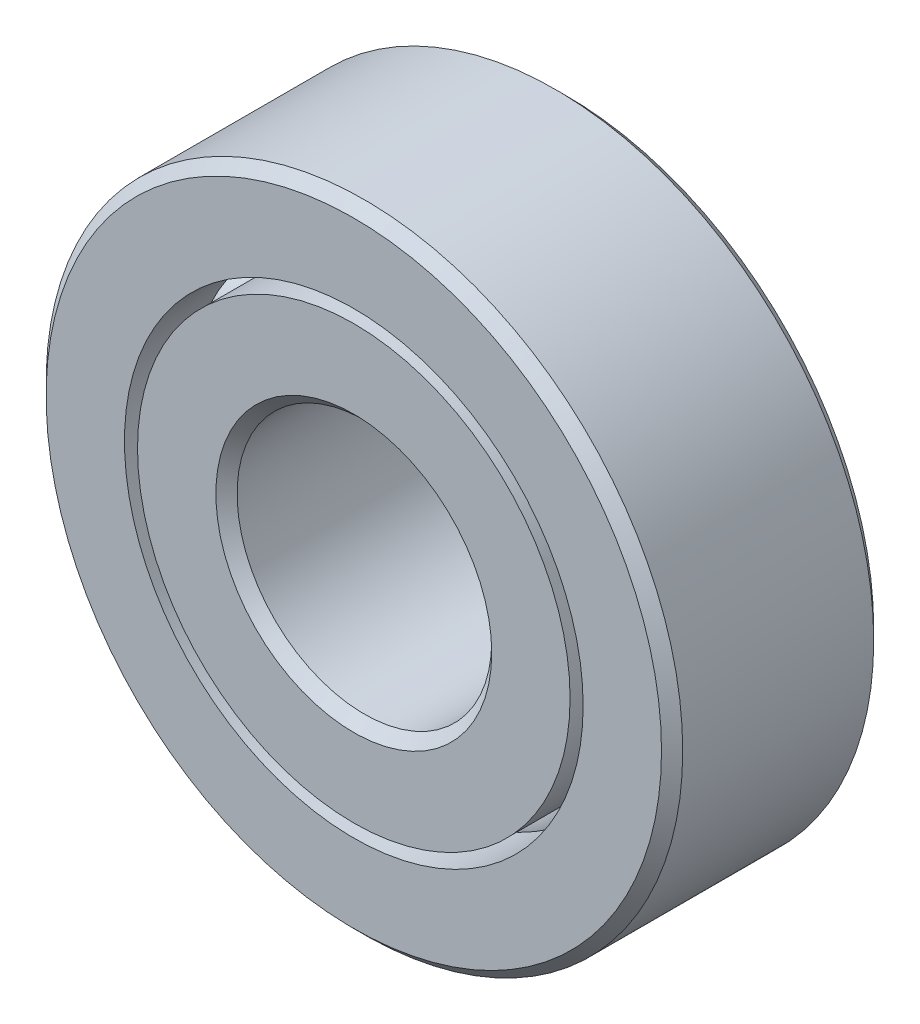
ISO-10303-21;
HEADER;
FILE_DESCRIPTION(('STEP AP214'),'2;1');
FILE_NAME('part.step','',(''),(''),'','','');
FILE_SCHEMA(('AUTOMOTIVE_DESIGN { 1 0 10303 214 1 1 1 1 }'));
ENDSEC;
DATA;
#1=APPLICATION_CONTEXT('core data for automotive mechanical design processes');
#2=APPLICATION_PROTOCOL_DEFINITION('international standard','automotive_design',2000,#1);
#3=PRODUCT_CONTEXT('',#1,'mechanical');
#4=PRODUCT('Part','Part','',(#3));
#5=PRODUCT_RELATED_PRODUCT_CATEGORY('part','',(#4));
#6=PRODUCT_DEFINITION_FORMATION('','',#4);
#7=PRODUCT_DEFINITION_CONTEXT('part definition',#1,'design');
#8=PRODUCT_DEFINITION('design','',#6,#7);
#9=PRODUCT_DEFINITION_SHAPE('','',#8);
#10=(LENGTH_UNIT() NAMED_UNIT(*) SI_UNIT(.MILLI.,.METRE.));
#11=(NAMED_UNIT(*) PLANE_ANGLE_UNIT() SI_UNIT($,.RADIAN.));
#12=(NAMED_UNIT(*) SI_UNIT($,.STERADIAN.) SOLID_ANGLE_UNIT());
#13=UNCERTAINTY_MEASURE_WITH_UNIT(LENGTH_MEASURE(1.E-05),#10,'distance_accuracy_value','');
#14=(GEOMETRIC_REPRESENTATION_CONTEXT(3) GLOBAL_UNCERTAINTY_ASSIGNED_CONTEXT((#13)) GLOBAL_UNIT_ASSIGNED_CONTEXT((#10,
#11,#12)) REPRESENTATION_CONTEXT('',''));
#15=CARTESIAN_POINT('',(0.,0.,0.));
#16=DIRECTION('',(0.,0.,1.));
#17=DIRECTION('',(1.,0.,0.));
#18=AXIS2_PLACEMENT_3D('',#15,#16,#17);
#19=CARTESIAN_POINT('',(-2.00908801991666,4.85036754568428,0.));
#20=DIRECTION('',(0.,0.,1.));
#21=DIRECTION('',(-0.382683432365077,0.923879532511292,0.));
#22=AXIS2_PLACEMENT_3D('',#19,#20,#21);
#23=SPHERICAL_SURFACE('',#22,1.);
#24=CARTESIAN_POINT('',(-2.00908801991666,4.85036754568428,1.));
#25=VERTEX_POINT('',#24);
#26=VERTEX_LOOP('',#25);
#27=FACE_BOUND('',#26,.T.);
#28=ADVANCED_FACE('F43',(#27),#23,.T.);
#29=CLOSED_SHELL('',(#28));
#30=MANIFOLD_SOLID_BREP('B2',#29);
#31=CARTESIAN_POINT('',(-3.71231060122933,3.71231060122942,0.));
#32=DIRECTION('',(0.,0.,1.));
#33=DIRECTION('',(-0.707106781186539,0.707106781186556,0.));
#34=AXIS2_PLACEMENT_3D('',#31,#32,#33);
#35=SPHERICAL_SURFACE('',#34,1.);
#36=CARTESIAN_POINT('',(-3.71231060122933,3.71231060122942,1.));
#37=VERTEX_POINT('',#36);
#38=VERTEX_LOOP('',#37);
#39=FACE_BOUND('',#38,.T.);
#40=ADVANCED_FACE('F63',(#39),#35,.T.);
#41=CLOSED_SHELL('',(#40));
#42=MANIFOLD_SOLID_BREP('B6',#41);
#43=CARTESIAN_POINT('',(-4.85036754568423,2.00908801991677,0.));
#44=DIRECTION('',(0.,0.,1.));
#45=DIRECTION('',(-0.923879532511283,0.3826834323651,0.));
#46=AXIS2_PLACEMENT_3D('',#43,#44,#45);
#47=SPHERICAL_SURFACE('',#46,1.);
#48=CARTESIAN_POINT('',(-4.85036754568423,2.00908801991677,1.));
#49=VERTEX_POINT('',#48);
#50=VERTEX_LOOP('',#49);
#51=FACE_BOUND('',#50,.T.);
#52=ADVANCED_FACE('F83',(#51),#47,.T.);
#53=CLOSED_SHELL('',(#52));
#54=MANIFOLD_SOLID_BREP('B39',#53);
#55=CARTESIAN_POINT('',(-5.25,0.,0.));
#56=DIRECTION('',(0.,0.,1.));
#57=DIRECTION('',(-1.,0.,0.));
#58=AXIS2_PLACEMENT_3D('',#55,#56,#57);
#59=SPHERICAL_SURFACE('',#58,1.);
#60=CARTESIAN_POINT('',(-5.25,0.,1.));
#61=VERTEX_POINT('',#60);
#62=VERTEX_LOOP('',#61);
#63=FACE_BOUND('',#62,.T.);
#64=ADVANCED_FACE('F103',(#63),#59,.T.);
#65=CLOSED_SHELL('',(#64));
#66=MANIFOLD_SOLID_BREP('B59',#65);
#67=CARTESIAN_POINT('',(-4.85036754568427,-2.00908801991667,0.));
#68=DIRECTION('',(0.,0.,1.));
#69=DIRECTION('',(-0.923879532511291,-0.382683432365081,0.));
#70=AXIS2_PLACEMENT_3D('',#67,#68,#69);
#71=SPHERICAL_SURFACE('',#70,1.);
#72=CARTESIAN_POINT('',(-4.85036754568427,-2.00908801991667,1.));
#73=VERTEX_POINT('',#72);
#74=VERTEX_LOOP('',#73);
#75=FACE_BOUND('',#74,.T.);
#76=ADVANCED_FACE('F123',(#75),#71,.T.);
#77=CLOSED_SHELL('',(#76));
#78=MANIFOLD_SOLID_BREP('B79',#77);
#79=CARTESIAN_POINT('',(-3.71231060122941,-3.71231060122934,0.));
#80=DIRECTION('',(0.,0.,1.));
#81=DIRECTION('',(-0.707106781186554,-0.707106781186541,0.));
#82=AXIS2_PLACEMENT_3D('',#79,#80,#81);
#83=SPHERICAL_SURFACE('',#82,1.);
#84=CARTESIAN_POINT('',(-3.71231060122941,-3.71231060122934,1.));
#85=VERTEX_POINT('',#84);
#86=VERTEX_LOOP('',#85);
#87=FACE_BOUND('',#86,.T.);
#88=ADVANCED_FACE('F143',(#87),#83,.T.);
#89=CLOSED_SHELL('',(#88));
#90=MANIFOLD_SOLID_BREP('B99',#89);
#91=CARTESIAN_POINT('',(-2.00908801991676,-4.85036754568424,0.));
#92=DIRECTION('',(0.,0.,1.));
#93=DIRECTION('',(-0.382683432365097,-0.923879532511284,0.));
#94=AXIS2_PLACEMENT_3D('',#91,#92,#93);
#95=SPHERICAL_SURFACE('',#94,1.);
#96=CARTESIAN_POINT('',(-2.00908801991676,-4.85036754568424,1.));
#97=VERTEX_POINT('',#96);
#98=VERTEX_LOOP('',#97);
#99=FACE_BOUND('',#98,.T.);
#100=ADVANCED_FACE('F163',(#99),#95,.T.);
#101=CLOSED_SHELL('',(#100));
#102=MANIFOLD_SOLID_BREP('B119',#101);
#103=CARTESIAN_POINT('',(0.,-5.25,0.));
#104=DIRECTION('',(0.,0.,1.));
#105=DIRECTION('',(0.,-1.,0.));
#106=AXIS2_PLACEMENT_3D('',#103,#104,#105);
#107=SPHERICAL_SURFACE('',#106,1.);
#108=CARTESIAN_POINT('',(0.,-5.25,1.));
#109=VERTEX_POINT('',#108);
#110=VERTEX_LOOP('',#109);
#111=FACE_BOUND('',#110,.T.);
#112=ADVANCED_FACE('F183',(#111),#107,.T.);
#113=CLOSED_SHELL('',(#112));
#114=MANIFOLD_SOLID_BREP('B139',#113);
#115=CARTESIAN_POINT('',(2.00908801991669,-4.85036754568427,0.));
#116=DIRECTION('',(0.,0.,1.));
#117=DIRECTION('',(0.382683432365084,-0.923879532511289,0.));
#118=AXIS2_PLACEMENT_3D('',#115,#116,#117);
#119=SPHERICAL_SURFACE('',#118,1.);
#120=CARTESIAN_POINT('',(2.00908801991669,-4.85036754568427,1.));
#121=VERTEX_POINT('',#120);
#122=VERTEX_LOOP('',#121);
#123=FACE_BOUND('',#122,.T.);
#124=ADVANCED_FACE('F203',(#123),#119,.T.);
#125=CLOSED_SHELL('',(#124));
#126=MANIFOLD_SOLID_BREP('B159',#125);
#127=CARTESIAN_POINT('',(3.71231060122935,-3.71231060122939,0.));
#128=DIRECTION('',(0.,0.,1.));
#129=DIRECTION('',(0.707106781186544,-0.707106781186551,0.));
#130=AXIS2_PLACEMENT_3D('',#127,#128,#129);
#131=SPHERICAL_SURFACE('',#130,1.);
#132=CARTESIAN_POINT('',(3.71231060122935,-3.71231060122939,1.));
#133=VERTEX_POINT('',#132);
#134=VERTEX_LOOP('',#133);
#135=FACE_BOUND('',#134,.T.);
#136=ADVANCED_FACE('F223',(#135),#131,.T.);
#137=CLOSED_SHELL('',(#136));
#138=MANIFOLD_SOLID_BREP('B179',#137);
#139=CARTESIAN_POINT('',(4.85036754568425,-2.00908801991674,0.));
#140=DIRECTION('',(0.,0.,1.));
#141=DIRECTION('',(0.923879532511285,-0.382683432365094,0.));
#142=AXIS2_PLACEMENT_3D('',#139,#140,#141);
#143=SPHERICAL_SURFACE('',#142,1.);
#144=CARTESIAN_POINT('',(4.85036754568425,-2.00908801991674,1.));
#145=VERTEX_POINT('',#144);
#146=VERTEX_LOOP('',#145);
#147=FACE_BOUND('',#146,.T.);
#148=ADVANCED_FACE('F243',(#147),#143,.T.);
#149=CLOSED_SHELL('',(#148));
#150=MANIFOLD_SOLID_BREP('B199',#149);
#151=CARTESIAN_POINT('',(5.25,0.,0.));
#152=DIRECTION('',(0.,0.,1.));
#153=DIRECTION('',(1.,0.,0.));
#154=AXIS2_PLACEMENT_3D('',#151,#152,#153);
#155=SPHERICAL_SURFACE('',#154,1.);
#156=CARTESIAN_POINT('',(5.25,0.,1.));
#157=VERTEX_POINT('',#156);
#158=VERTEX_LOOP('',#157);
#159=FACE_BOUND('',#158,.T.);
#160=ADVANCED_FACE('F263',(#159),#155,.T.);
#161=CLOSED_SHELL('',(#160));
#162=MANIFOLD_SOLID_BREP('B219',#161);
#163=CARTESIAN_POINT('',(4.85036754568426,2.00908801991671,0.));
#164=DIRECTION('',(0.,0.,1.));
#165=DIRECTION('',(0.923879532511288,0.382683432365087,0.));
#166=AXIS2_PLACEMENT_3D('',#163,#164,#165);
#167=SPHERICAL_SURFACE('',#166,1.);
#168=CARTESIAN_POINT('',(4.85036754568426,2.00908801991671,1.));
#169=VERTEX_POINT('',#168);
#170=VERTEX_LOOP('',#169);
#171=FACE_BOUND('',#170,.T.);
#172=ADVANCED_FACE('F283',(#171),#167,.T.);
#173=CLOSED_SHELL('',(#172));
#174=MANIFOLD_SOLID_BREP('B239',#173);
#175=CARTESIAN_POINT('',(3.71231060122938,3.71231060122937,0.));
#176=DIRECTION('',(0.,0.,1.));
#177=DIRECTION('',(0.707106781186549,0.707106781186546,0.));
#178=AXIS2_PLACEMENT_3D('',#175,#176,#177);
#179=SPHERICAL_SURFACE('',#178,1.);
#180=CARTESIAN_POINT('',(3.71231060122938,3.71231060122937,1.));
#181=VERTEX_POINT('',#180);
#182=VERTEX_LOOP('',#181);
#183=FACE_BOUND('',#182,.T.);
#184=ADVANCED_FACE('F303',(#183),#179,.T.);
#185=CLOSED_SHELL('',(#184));
#186=MANIFOLD_SOLID_BREP('B259',#185);
#187=CARTESIAN_POINT('',(2.00908801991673,4.85036754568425,0.));
#188=DIRECTION('',(0.,0.,1.));
#189=DIRECTION('',(0.382683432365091,0.923879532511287,0.));
#190=AXIS2_PLACEMENT_3D('',#187,#188,#189);
#191=SPHERICAL_SURFACE('',#190,1.);
#192=CARTESIAN_POINT('',(2.00908801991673,4.85036754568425,1.));
#193=VERTEX_POINT('',#192);
#194=VERTEX_LOOP('',#193);
#195=FACE_BOUND('',#194,.T.);
#196=ADVANCED_FACE('F323',(#195),#191,.T.);
#197=CLOSED_SHELL('',(#196));
#198=MANIFOLD_SOLID_BREP('B279',#197);
#199=CARTESIAN_POINT('',(0.,5.25,0.));
#200=DIRECTION('',(0.,0.,1.));
#201=DIRECTION('',(0.,1.,0.));
#202=AXIS2_PLACEMENT_3D('',#199,#200,#201);
#203=SPHERICAL_SURFACE('',#202,1.);
#204=CARTESIAN_POINT('',(0.,5.25,1.));
#205=VERTEX_POINT('',#204);
#206=VERTEX_LOOP('',#205);
#207=FACE_BOUND('',#206,.T.);
#208=ADVANCED_FACE('F345',(#207),#203,.T.);
#209=CLOSED_SHELL('',(#208));
#210=MANIFOLD_SOLID_BREP('B299',#209);
#211=CARTESIAN_POINT('',(0.,5.09615384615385,2.5));
#212=DIRECTION('',(0.,0.,-1.));
#213=DIRECTION('',(-1.,0.,0.));
#214=AXIS2_PLACEMENT_3D('',#211,#212,#213);
#215=PLANE('',#214);
#216=CARTESIAN_POINT('',(0.,0.,2.5));
#217=DIRECTION('',(0.,0.,1.));
#218=DIRECTION('',(1.,0.,0.));
#219=AXIS2_PLACEMENT_3D('',#216,#217,#218);
#220=CIRCLE('',#219,3.25);
#221=CARTESIAN_POINT('',(3.25,0.,2.5));
#222=VERTEX_POINT('',#221);
#223=EDGE_CURVE('E392',#222,#222,#220,.T.);
#224=ORIENTED_EDGE('',*,*,#223,.F.);
#225=EDGE_LOOP('',(#224));
#226=FACE_BOUND('',#225,.T.);
#227=CARTESIAN_POINT('',(0.,0.,2.5));
#228=DIRECTION('',(0.,0.,1.));
#229=DIRECTION('',(1.,0.,0.));
#230=AXIS2_PLACEMENT_3D('',#227,#228,#229);
#231=CIRCLE('',#230,5.09615384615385);
#232=CARTESIAN_POINT('',(5.09615384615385,0.,2.5));
#233=VERTEX_POINT('',#232);
#234=EDGE_CURVE('E344',#233,#233,#231,.T.);
#235=ORIENTED_EDGE('',*,*,#234,.T.);
#236=EDGE_LOOP('',(#235));
#237=FACE_BOUND('',#236,.T.);
#238=ADVANCED_FACE('F364',(#226,#237),#215,.F.);
#239=CARTESIAN_POINT('',(0.,0.,2.5));
#240=DIRECTION('',(0.,0.,1.));
#241=DIRECTION('',(1.,0.,0.));
#242=AXIS2_PLACEMENT_3D('',#239,#240,#241);
#243=CYLINDRICAL_SURFACE('',#242,5.09615384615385);
#244=ORIENTED_EDGE('',*,*,#234,.F.);
#245=EDGE_LOOP('',(#244));
#246=FACE_BOUND('',#245,.T.);
#247=CARTESIAN_POINT('',(0.,0.,0.988094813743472));
#248=DIRECTION('',(0.,0.,1.));
#249=DIRECTION('',(1.,0.,0.));
#250=AXIS2_PLACEMENT_3D('',#247,#248,#249);
#251=CIRCLE('',#250,5.09615384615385);
#252=CARTESIAN_POINT('',(5.09615384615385,0.,0.988094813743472));
#253=VERTEX_POINT('',#252);
#254=EDGE_CURVE('E370',#253,#253,#251,.T.);
#255=ORIENTED_EDGE('',*,*,#254,.T.);
#256=EDGE_LOOP('',(#255));
#257=FACE_BOUND('',#256,.T.);
#258=ADVANCED_FACE('F399',(#246,#257),#243,.T.);
#259=CARTESIAN_POINT('',(0.,0.,0.));
#260=DIRECTION('',(0.,0.,1.));
#261=DIRECTION('',(1.,0.,0.));
#262=AXIS2_PLACEMENT_3D('',#259,#260,#261);
#263=TOROIDAL_SURFACE('',#262,5.25,1.);
#264=ORIENTED_EDGE('',*,*,#254,.F.);
#265=EDGE_LOOP('',(#264));
#266=FACE_BOUND('',#265,.T.);
#267=CARTESIAN_POINT('',(0.,0.,-0.988094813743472));
#268=DIRECTION('',(0.,0.,1.));
#269=DIRECTION('',(1.,0.,0.));
#270=AXIS2_PLACEMENT_3D('',#267,#268,#269);
#271=CIRCLE('',#270,5.09615384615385);
#272=CARTESIAN_POINT('',(5.09615384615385,0.,-0.988094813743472));
#273=VERTEX_POINT('',#272);
#274=EDGE_CURVE('E374',#273,#273,#271,.T.);
#275=ORIENTED_EDGE('',*,*,#274,.T.);
#276=EDGE_LOOP('',(#275));
#277=FACE_BOUND('',#276,.T.);
#278=ADVANCED_FACE('F403',(#266,#277),#263,.F.);
#279=CARTESIAN_POINT('',(0.,0.,2.5));
#280=DIRECTION('',(0.,0.,1.));
#281=DIRECTION('',(1.,0.,0.));
#282=AXIS2_PLACEMENT_3D('',#279,#280,#281);
#283=CYLINDRICAL_SURFACE('',#282,5.09615384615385);
#284=ORIENTED_EDGE('',*,*,#274,.F.);
#285=EDGE_LOOP('',(#284));
#286=FACE_BOUND('',#285,.T.);
#287=CARTESIAN_POINT('',(0.,0.,-2.5));
#288=DIRECTION('',(0.,0.,1.));
#289=DIRECTION('',(1.,0.,0.));
#290=AXIS2_PLACEMENT_3D('',#287,#288,#289);
#291=CIRCLE('',#290,5.09615384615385);
#292=CARTESIAN_POINT('',(5.09615384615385,0.,-2.5));
#293=VERTEX_POINT('',#292);
#294=EDGE_CURVE('E378',#293,#293,#291,.T.);
#295=ORIENTED_EDGE('',*,*,#294,.T.);
#296=EDGE_LOOP('',(#295));
#297=FACE_BOUND('',#296,.T.);
#298=ADVANCED_FACE('F408',(#286,#297),#283,.T.);
#299=CARTESIAN_POINT('',(0.,3.25,-2.5));
#300=DIRECTION('',(0.,0.,1.));
#301=DIRECTION('',(1.,0.,0.));
#302=AXIS2_PLACEMENT_3D('',#299,#300,#301);
#303=PLANE('',#302);
#304=ORIENTED_EDGE('',*,*,#294,.F.);
#305=EDGE_LOOP('',(#304));
#306=FACE_BOUND('',#305,.T.);
#307=CARTESIAN_POINT('',(0.,0.,-2.5));
#308=DIRECTION('',(0.,0.,1.));
#309=DIRECTION('',(1.,0.,0.));
#310=AXIS2_PLACEMENT_3D('',#307,#308,#309);
#311=CIRCLE('',#310,3.25);
#312=CARTESIAN_POINT('',(3.25,0.,-2.5));
#313=VERTEX_POINT('',#312);
#314=EDGE_CURVE('E383',#313,#313,#311,.T.);
#315=ORIENTED_EDGE('',*,*,#314,.T.);
#316=EDGE_LOOP('',(#315));
#317=FACE_BOUND('',#316,.T.);
#318=ADVANCED_FACE('F414',(#306,#317),#303,.F.);
#319=CARTESIAN_POINT('',(0.,0.,-2.25));
#320=DIRECTION('',(0.,0.,-1.));
#321=DIRECTION('',(-1.,0.,0.));
#322=AXIS2_PLACEMENT_3D('',#319,#320,#321);
#323=CONICAL_SURFACE('',#322,3.,0.785398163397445);
#324=ORIENTED_EDGE('',*,*,#314,.F.);
#325=EDGE_LOOP('',(#324));
#326=FACE_BOUND('',#325,.T.);
#327=CARTESIAN_POINT('',(0.,0.,-2.25));
#328=DIRECTION('',(0.,0.,1.));
#329=DIRECTION('',(1.,0.,0.));
#330=AXIS2_PLACEMENT_3D('',#327,#328,#329);
#331=CIRCLE('',#330,3.);
#332=CARTESIAN_POINT('',(3.,0.,-2.25));
#333=VERTEX_POINT('',#332);
#334=EDGE_CURVE('E386',#333,#333,#331,.T.);
#335=ORIENTED_EDGE('',*,*,#334,.T.);
#336=EDGE_LOOP('',(#335));
#337=FACE_BOUND('',#336,.T.);
#338=ADVANCED_FACE('F418',(#326,#337),#323,.F.);
#339=CARTESIAN_POINT('',(0.,0.,2.5));
#340=DIRECTION('',(0.,0.,1.));
#341=DIRECTION('',(1.,0.,0.));
#342=AXIS2_PLACEMENT_3D('',#339,#340,#341);
#343=CYLINDRICAL_SURFACE('',#342,3.);
#344=ORIENTED_EDGE('',*,*,#334,.F.);
#345=EDGE_LOOP('',(#344));
#346=FACE_BOUND('',#345,.T.);
#347=CARTESIAN_POINT('',(0.,0.,2.25));
#348=DIRECTION('',(0.,0.,1.));
#349=DIRECTION('',(1.,0.,0.));
#350=AXIS2_PLACEMENT_3D('',#347,#348,#349);
#351=CIRCLE('',#350,3.);
#352=CARTESIAN_POINT('',(3.,0.,2.25));
#353=VERTEX_POINT('',#352);
#354=EDGE_CURVE('E389',#353,#353,#351,.T.);
#355=ORIENTED_EDGE('',*,*,#354,.T.);
#356=EDGE_LOOP('',(#355));
#357=FACE_BOUND('',#356,.T.);
#358=ADVANCED_FACE('F422',(#346,#357),#343,.F.);
#359=CARTESIAN_POINT('',(0.,0.,2.5));
#360=DIRECTION('',(0.,0.,1.));
#361=DIRECTION('',(1.,0.,0.));
#362=AXIS2_PLACEMENT_3D('',#359,#360,#361);
#363=CONICAL_SURFACE('',#362,3.25,0.785398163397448);
#364=ORIENTED_EDGE('',*,*,#354,.F.);
#365=EDGE_LOOP('',(#364));
#366=FACE_BOUND('',#365,.T.);
#367=ORIENTED_EDGE('',*,*,#223,.T.);
#368=EDGE_LOOP('',(#367));
#369=FACE_BOUND('',#368,.T.);
#370=ADVANCED_FACE('F396',(#366,#369),#363,.F.);
#371=CLOSED_SHELL('',(#238,#258,#278,#298,#318,#338,#358,#370));
#372=MANIFOLD_SOLID_BREP('B319',#371);
#373=CARTESIAN_POINT('',(0.,0.,2.25));
#374=DIRECTION('',(0.,0.,-1.));
#375=DIRECTION('',(-1.,0.,0.));
#376=AXIS2_PLACEMENT_3D('',#373,#374,#375);
#377=CONICAL_SURFACE('',#376,7.5,0.785398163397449);
#378=CARTESIAN_POINT('',(0.,0.,2.5));
#379=DIRECTION('',(0.,0.,1.));
#380=DIRECTION('',(1.,0.,0.));
#381=AXIS2_PLACEMENT_3D('',#378,#379,#380);
#382=CIRCLE('',#381,7.25);
#383=CARTESIAN_POINT('',(7.25,0.,2.5));
#384=VERTEX_POINT('',#383);
#385=EDGE_CURVE('E531',#384,#384,#382,.T.);
#386=ORIENTED_EDGE('',*,*,#385,.F.);
#387=EDGE_LOOP('',(#386));
#388=FACE_BOUND('',#387,.T.);
#389=CARTESIAN_POINT('',(0.,0.,2.25));
#390=DIRECTION('',(0.,0.,1.));
#391=DIRECTION('',(1.,0.,0.));
#392=AXIS2_PLACEMENT_3D('',#389,#390,#391);
#393=CIRCLE('',#392,7.5);
#394=CARTESIAN_POINT('',(7.5,0.,2.25));
#395=VERTEX_POINT('',#394);
#396=EDGE_CURVE('E363',#395,#395,#393,.T.);
#397=ORIENTED_EDGE('',*,*,#396,.T.);
#398=EDGE_LOOP('',(#397));
#399=FACE_BOUND('',#398,.T.);
#400=ADVANCED_FACE('F503',(#388,#399),#377,.T.);
#401=CARTESIAN_POINT('',(0.,0.,2.5));
#402=DIRECTION('',(0.,0.,1.));
#403=DIRECTION('',(1.,0.,0.));
#404=AXIS2_PLACEMENT_3D('',#401,#402,#403);
#405=CYLINDRICAL_SURFACE('',#404,7.5);
#406=ORIENTED_EDGE('',*,*,#396,.F.);
#407=EDGE_LOOP('',(#406));
#408=FACE_BOUND('',#407,.T.);
#409=CARTESIAN_POINT('',(0.,0.,-2.25));
#410=DIRECTION('',(0.,0.,1.));
#411=DIRECTION('',(1.,0.,0.));
#412=AXIS2_PLACEMENT_3D('',#409,#410,#411);
#413=CIRCLE('',#412,7.5);
#414=CARTESIAN_POINT('',(7.5,0.,-2.25));
#415=VERTEX_POINT('',#414);
#416=EDGE_CURVE('E509',#415,#415,#413,.T.);
#417=ORIENTED_EDGE('',*,*,#416,.T.);
#418=EDGE_LOOP('',(#417));
#419=FACE_BOUND('',#418,.T.);
#420=ADVANCED_FACE('F538',(#408,#419),#405,.T.);
#421=CARTESIAN_POINT('',(0.,0.,-2.5));
#422=DIRECTION('',(0.,0.,1.));
#423=DIRECTION('',(1.,0.,0.));
#424=AXIS2_PLACEMENT_3D('',#421,#422,#423);
#425=CONICAL_SURFACE('',#424,7.25,0.785398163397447);
#426=ORIENTED_EDGE('',*,*,#416,.F.);
#427=EDGE_LOOP('',(#426));
#428=FACE_BOUND('',#427,.T.);
#429=CARTESIAN_POINT('',(0.,0.,-2.5));
#430=DIRECTION('',(0.,0.,1.));
#431=DIRECTION('',(1.,0.,0.));
#432=AXIS2_PLACEMENT_3D('',#429,#430,#431);
#433=CIRCLE('',#432,7.25);
#434=CARTESIAN_POINT('',(7.25,0.,-2.5));
#435=VERTEX_POINT('',#434);
#436=EDGE_CURVE('E513',#435,#435,#433,.T.);
#437=ORIENTED_EDGE('',*,*,#436,.T.);
#438=EDGE_LOOP('',(#437));
#439=FACE_BOUND('',#438,.T.);
#440=ADVANCED_FACE('F542',(#428,#439),#425,.T.);
#441=CARTESIAN_POINT('',(0.,7.25,-2.5));
#442=DIRECTION('',(0.,0.,1.));
#443=DIRECTION('',(1.,0.,0.));
#444=AXIS2_PLACEMENT_3D('',#441,#442,#443);
#445=PLANE('',#444);
#446=ORIENTED_EDGE('',*,*,#436,.F.);
#447=EDGE_LOOP('',(#446));
#448=FACE_BOUND('',#447,.T.);
#449=CARTESIAN_POINT('',(0.,0.,-2.5));
#450=DIRECTION('',(0.,0.,1.));
#451=DIRECTION('',(1.,0.,0.));
#452=AXIS2_PLACEMENT_3D('',#449,#450,#451);
#453=CIRCLE('',#452,5.40384615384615);
#454=CARTESIAN_POINT('',(5.40384615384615,0.,-2.5));
#455=VERTEX_POINT('',#454);
#456=EDGE_CURVE('E517',#455,#455,#453,.T.);
#457=ORIENTED_EDGE('',*,*,#456,.T.);
#458=EDGE_LOOP('',(#457));
#459=FACE_BOUND('',#458,.T.);
#460=ADVANCED_FACE('F547',(#448,#459),#445,.F.);
#461=CARTESIAN_POINT('',(0.,0.,2.5));
#462=DIRECTION('',(0.,0.,1.));
#463=DIRECTION('',(1.,0.,0.));
#464=AXIS2_PLACEMENT_3D('',#461,#462,#463);
#465=CYLINDRICAL_SURFACE('',#464,5.40384615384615);
#466=ORIENTED_EDGE('',*,*,#456,.F.);
#467=EDGE_LOOP('',(#466));
#468=FACE_BOUND('',#467,.T.);
#469=CARTESIAN_POINT('',(0.,0.,-0.988094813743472));
#470=DIRECTION('',(0.,0.,1.));
#471=DIRECTION('',(1.,0.,0.));
#472=AXIS2_PLACEMENT_3D('',#469,#470,#471);
#473=CIRCLE('',#472,5.40384615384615);
#474=CARTESIAN_POINT('',(5.40384615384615,0.,-0.988094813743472));
#475=VERTEX_POINT('',#474);
#476=EDGE_CURVE('E522',#475,#475,#473,.T.);
#477=ORIENTED_EDGE('',*,*,#476,.T.);
#478=EDGE_LOOP('',(#477));
#479=FACE_BOUND('',#478,.T.);
#480=ADVANCED_FACE('F553',(#468,#479),#465,.F.);
#481=CARTESIAN_POINT('',(0.,0.,0.));
#482=DIRECTION('',(0.,0.,1.));
#483=DIRECTION('',(1.,0.,0.));
#484=AXIS2_PLACEMENT_3D('',#481,#482,#483);
#485=TOROIDAL_SURFACE('',#484,5.25,1.);
#486=ORIENTED_EDGE('',*,*,#476,.F.);
#487=EDGE_LOOP('',(#486));
#488=FACE_BOUND('',#487,.T.);
#489=CARTESIAN_POINT('',(0.,0.,0.988094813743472));
#490=DIRECTION('',(0.,0.,1.));
#491=DIRECTION('',(1.,0.,0.));
#492=AXIS2_PLACEMENT_3D('',#489,#490,#491);
#493=CIRCLE('',#492,5.40384615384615);
#494=CARTESIAN_POINT('',(5.40384615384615,0.,0.988094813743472));
#495=VERTEX_POINT('',#494);
#496=EDGE_CURVE('E525',#495,#495,#493,.T.);
#497=ORIENTED_EDGE('',*,*,#496,.T.);
#498=EDGE_LOOP('',(#497));
#499=FACE_BOUND('',#498,.T.);
#500=ADVANCED_FACE('F557',(#488,#499),#485,.F.);
#501=CARTESIAN_POINT('',(0.,0.,2.5));
#502=DIRECTION('',(0.,0.,1.));
#503=DIRECTION('',(1.,0.,0.));
#504=AXIS2_PLACEMENT_3D('',#501,#502,#503);
#505=CYLINDRICAL_SURFACE('',#504,5.40384615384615);
#506=ORIENTED_EDGE('',*,*,#496,.F.);
#507=EDGE_LOOP('',(#506));
#508=FACE_BOUND('',#507,.T.);
#509=CARTESIAN_POINT('',(0.,0.,2.5));
#510=DIRECTION('',(0.,0.,1.));
#511=DIRECTION('',(1.,0.,0.));
#512=AXIS2_PLACEMENT_3D('',#509,#510,#511);
#513=CIRCLE('',#512,5.40384615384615);
#514=CARTESIAN_POINT('',(5.40384615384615,0.,2.5));
#515=VERTEX_POINT('',#514);
#516=EDGE_CURVE('E528',#515,#515,#513,.T.);
#517=ORIENTED_EDGE('',*,*,#516,.T.);
#518=EDGE_LOOP('',(#517));
#519=FACE_BOUND('',#518,.T.);
#520=ADVANCED_FACE('F561',(#508,#519),#505,.F.);
#521=CARTESIAN_POINT('',(0.,7.25,2.5));
#522=DIRECTION('',(0.,0.,-1.));
#523=DIRECTION('',(-1.,0.,0.));
#524=AXIS2_PLACEMENT_3D('',#521,#522,#523);
#525=PLANE('',#524);
#526=ORIENTED_EDGE('',*,*,#516,.F.);
#527=EDGE_LOOP('',(#526));
#528=FACE_BOUND('',#527,.T.);
#529=ORIENTED_EDGE('',*,*,#385,.T.);
#530=EDGE_LOOP('',(#529));
#531=FACE_BOUND('',#530,.T.);
#532=ADVANCED_FACE('F535',(#528,#531),#525,.F.);
#533=CLOSED_SHELL('',(#400,#420,#440,#460,#480,#500,#520,#532));
#534=MANIFOLD_SOLID_BREP('B339',#533);
#535=ADVANCED_BREP_SHAPE_REPRESENTATION('',(#18,#30,#42,#54,#66,#78,#90,#102,#114,#126,#138,
#150,#162,#174,#186,#198,#210,#372,#534),#14);
#536=SHAPE_DEFINITION_REPRESENTATION(#9,#535);
ENDSEC;
END-ISO-10303-21;
